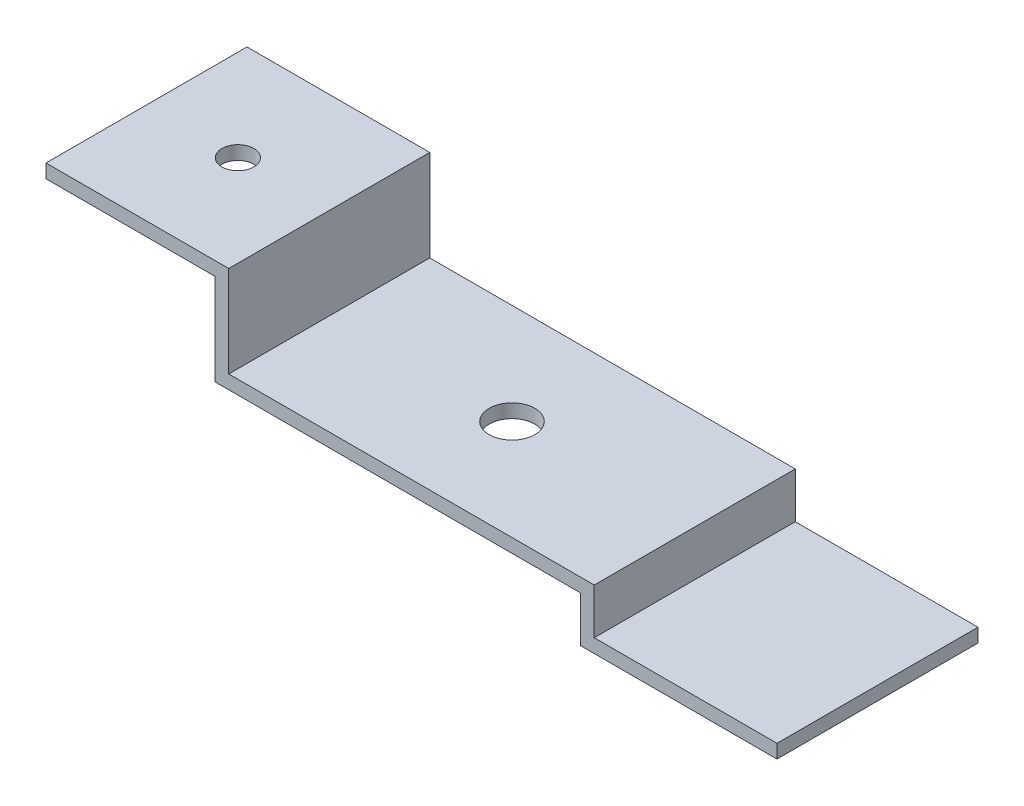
ISO-10303-21;
HEADER;
FILE_DESCRIPTION(('STEP AP214'),'2;1');
FILE_NAME('part.step','',(''),(''),'','','');
FILE_SCHEMA(('AUTOMOTIVE_DESIGN { 1 0 10303 214 1 1 1 1 }'));
ENDSEC;
DATA;
#1=APPLICATION_CONTEXT('core data for automotive mechanical design processes');
#2=APPLICATION_PROTOCOL_DEFINITION('international standard','automotive_design',2000,#1);
#3=PRODUCT_CONTEXT('',#1,'mechanical');
#4=PRODUCT('Part','Part','',(#3));
#5=PRODUCT_RELATED_PRODUCT_CATEGORY('part','',(#4));
#6=PRODUCT_DEFINITION_FORMATION('','',#4);
#7=PRODUCT_DEFINITION_CONTEXT('part definition',#1,'design');
#8=PRODUCT_DEFINITION('design','',#6,#7);
#9=PRODUCT_DEFINITION_SHAPE('','',#8);
#10=(LENGTH_UNIT() NAMED_UNIT(*) SI_UNIT(.MILLI.,.METRE.));
#11=(NAMED_UNIT(*) PLANE_ANGLE_UNIT() SI_UNIT($,.RADIAN.));
#12=(NAMED_UNIT(*) SI_UNIT($,.STERADIAN.) SOLID_ANGLE_UNIT());
#13=UNCERTAINTY_MEASURE_WITH_UNIT(LENGTH_MEASURE(1.E-05),#10,'distance_accuracy_value','');
#14=(GEOMETRIC_REPRESENTATION_CONTEXT(3) GLOBAL_UNCERTAINTY_ASSIGNED_CONTEXT((#13)) GLOBAL_UNIT_ASSIGNED_CONTEXT((#10,
#11,#12)) REPRESENTATION_CONTEXT('',''));
#15=CARTESIAN_POINT('',(0.,0.,0.));
#16=DIRECTION('',(0.,0.,1.));
#17=DIRECTION('',(1.,0.,0.));
#18=AXIS2_PLACEMENT_3D('',#15,#16,#17);
#19=CARTESIAN_POINT('',(0.,1.5,22.));
#20=DIRECTION('',(-1.,0.,0.));
#21=DIRECTION('',(0.,0.,1.));
#22=AXIS2_PLACEMENT_3D('',#19,#20,#21);
#23=PLANE('',#22);
#24=DIRECTION('',(0.,1.,0.));
#25=VECTOR('',#24,1.);
#26=CARTESIAN_POINT('',(0.,1.5,0.));
#27=LINE('',#26,#25);
#28=CARTESIAN_POINT('',(0.,0.,0.));
#29=VERTEX_POINT('',#28);
#30=CARTESIAN_POINT('',(0.,1.5,0.));
#31=VERTEX_POINT('',#30);
#32=EDGE_CURVE('E124',#29,#31,#27,.T.);
#33=ORIENTED_EDGE('',*,*,#32,.T.);
#34=DIRECTION('',(0.,0.,-1.));
#35=VECTOR('',#34,1.);
#36=CARTESIAN_POINT('',(0.,1.5,22.));
#37=LINE('',#36,#35);
#38=CARTESIAN_POINT('',(0.,1.5,22.));
#39=VERTEX_POINT('',#38);
#40=EDGE_CURVE('E11',#39,#31,#37,.T.);
#41=ORIENTED_EDGE('',*,*,#40,.F.);
#42=DIRECTION('',(0.,1.,0.));
#43=VECTOR('',#42,1.);
#44=CARTESIAN_POINT('',(0.,1.5,22.));
#45=LINE('',#44,#43);
#46=CARTESIAN_POINT('',(0.,0.,22.));
#47=VERTEX_POINT('',#46);
#48=EDGE_CURVE('E164',#47,#39,#45,.T.);
#49=ORIENTED_EDGE('',*,*,#48,.F.);
#50=DIRECTION('',(0.,0.,-1.));
#51=VECTOR('',#50,1.);
#52=CARTESIAN_POINT('',(0.,0.,22.));
#53=LINE('',#52,#51);
#54=EDGE_CURVE('E137',#47,#29,#53,.T.);
#55=ORIENTED_EDGE('',*,*,#54,.T.);
#56=EDGE_LOOP('',(#33,#41,#49,#55));
#57=FACE_BOUND('',#56,.T.);
#58=ADVANCED_FACE('F30',(#57),#23,.F.);
#59=CARTESIAN_POINT('',(-20.,1.5,22.));
#60=DIRECTION('',(0.,-1.,0.));
#61=DIRECTION('',(0.,0.,-1.));
#62=AXIS2_PLACEMENT_3D('',#59,#60,#61);
#63=PLANE('',#62);
#64=DIRECTION('',(-1.,0.,0.));
#65=VECTOR('',#64,1.);
#66=CARTESIAN_POINT('',(-20.,1.5,0.));
#67=LINE('',#66,#65);
#68=CARTESIAN_POINT('',(-20.,1.5,0.));
#69=VERTEX_POINT('',#68);
#70=EDGE_CURVE('E120',#31,#69,#67,.T.);
#71=ORIENTED_EDGE('',*,*,#70,.T.);
#72=DIRECTION('',(0.,0.,-1.));
#73=VECTOR('',#72,1.);
#74=CARTESIAN_POINT('',(-20.,1.5,22.));
#75=LINE('',#74,#73);
#76=CARTESIAN_POINT('',(-20.,1.5,22.));
#77=VERTEX_POINT('',#76);
#78=EDGE_CURVE('E38',#77,#69,#75,.T.);
#79=ORIENTED_EDGE('',*,*,#78,.F.);
#80=DIRECTION('',(-1.,0.,0.));
#81=VECTOR('',#80,1.);
#82=CARTESIAN_POINT('',(-20.,1.5,22.));
#83=LINE('',#82,#81);
#84=EDGE_CURVE('E133',#39,#77,#83,.T.);
#85=ORIENTED_EDGE('',*,*,#84,.F.);
#86=ORIENTED_EDGE('',*,*,#40,.T.);
#87=EDGE_LOOP('',(#71,#79,#85,#86));
#88=FACE_BOUND('',#87,.T.);
#89=ADVANCED_FACE('F132',(#88),#63,.F.);
#90=CARTESIAN_POINT('',(-20.,6.5,22.));
#91=DIRECTION('',(-1.,0.,0.));
#92=DIRECTION('',(0.,0.,1.));
#93=AXIS2_PLACEMENT_3D('',#90,#91,#92);
#94=PLANE('',#93);
#95=DIRECTION('',(0.,1.,0.));
#96=VECTOR('',#95,1.);
#97=CARTESIAN_POINT('',(-20.,6.5,0.));
#98=LINE('',#97,#96);
#99=CARTESIAN_POINT('',(-20.,6.5,0.));
#100=VERTEX_POINT('',#99);
#101=EDGE_CURVE('E126',#69,#100,#98,.T.);
#102=ORIENTED_EDGE('',*,*,#101,.T.);
#103=DIRECTION('',(0.,0.,-1.));
#104=VECTOR('',#103,1.);
#105=CARTESIAN_POINT('',(-20.,6.5,22.));
#106=LINE('',#105,#104);
#107=CARTESIAN_POINT('',(-20.,6.5,22.));
#108=VERTEX_POINT('',#107);
#109=EDGE_CURVE('E210',#108,#100,#106,.T.);
#110=ORIENTED_EDGE('',*,*,#109,.F.);
#111=DIRECTION('',(0.,1.,0.));
#112=VECTOR('',#111,1.);
#113=CARTESIAN_POINT('',(-20.,6.5,22.));
#114=LINE('',#113,#112);
#115=EDGE_CURVE('E167',#77,#108,#114,.T.);
#116=ORIENTED_EDGE('',*,*,#115,.F.);
#117=ORIENTED_EDGE('',*,*,#78,.T.);
#118=EDGE_LOOP('',(#102,#110,#116,#117));
#119=FACE_BOUND('',#118,.T.);
#120=ADVANCED_FACE('F215',(#119),#94,.F.);
#121=CARTESIAN_POINT('',(-60.,6.5,22.));
#122=DIRECTION('',(0.,-1.,0.));
#123=DIRECTION('',(0.,0.,-1.));
#124=AXIS2_PLACEMENT_3D('',#121,#122,#123);
#125=PLANE('',#124);
#126=CARTESIAN_POINT('',(-40.,6.5,11.));
#127=DIRECTION('',(0.,1.,0.));
#128=DIRECTION('',(0.,0.,1.));
#129=AXIS2_PLACEMENT_3D('',#126,#127,#128);
#130=CIRCLE('',#129,2.5);
#131=CARTESIAN_POINT('',(-40.,6.5,13.5));
#132=VERTEX_POINT('',#131);
#133=EDGE_CURVE('E296',#132,#132,#130,.T.);
#134=ORIENTED_EDGE('',*,*,#133,.F.);
#135=EDGE_LOOP('',(#134));
#136=FACE_BOUND('',#135,.T.);
#137=DIRECTION('',(-1.,0.,0.));
#138=VECTOR('',#137,1.);
#139=CARTESIAN_POINT('',(-60.,6.5,0.));
#140=LINE('',#139,#138);
#141=CARTESIAN_POINT('',(-60.,6.5,0.));
#142=VERTEX_POINT('',#141);
#143=EDGE_CURVE('E146',#100,#142,#140,.T.);
#144=ORIENTED_EDGE('',*,*,#143,.T.);
#145=DIRECTION('',(0.,0.,-1.));
#146=VECTOR('',#145,1.);
#147=CARTESIAN_POINT('',(-60.,6.5,22.));
#148=LINE('',#147,#146);
#149=CARTESIAN_POINT('',(-60.,6.5,22.));
#150=VERTEX_POINT('',#149);
#151=EDGE_CURVE('E207',#150,#142,#148,.T.);
#152=ORIENTED_EDGE('',*,*,#151,.F.);
#153=DIRECTION('',(-1.,0.,0.));
#154=VECTOR('',#153,1.);
#155=CARTESIAN_POINT('',(-60.,6.5,22.));
#156=LINE('',#155,#154);
#157=EDGE_CURVE('E169',#108,#150,#156,.T.);
#158=ORIENTED_EDGE('',*,*,#157,.F.);
#159=ORIENTED_EDGE('',*,*,#109,.T.);
#160=EDGE_LOOP('',(#144,#152,#158,#159));
#161=FACE_BOUND('',#160,.T.);
#162=ADVANCED_FACE('F223',(#136,#161),#125,.F.);
#163=CARTESIAN_POINT('',(-60.,16.5,22.));
#164=DIRECTION('',(-1.,0.,0.));
#165=DIRECTION('',(0.,0.,1.));
#166=AXIS2_PLACEMENT_3D('',#163,#164,#165);
#167=PLANE('',#166);
#168=DIRECTION('',(0.,1.,0.));
#169=VECTOR('',#168,1.);
#170=CARTESIAN_POINT('',(-60.,16.5,0.));
#171=LINE('',#170,#169);
#172=CARTESIAN_POINT('',(-60.,16.5,0.));
#173=VERTEX_POINT('',#172);
#174=EDGE_CURVE('E148',#142,#173,#171,.T.);
#175=ORIENTED_EDGE('',*,*,#174,.T.);
#176=DIRECTION('',(0.,0.,-1.));
#177=VECTOR('',#176,1.);
#178=CARTESIAN_POINT('',(-60.,16.5,22.));
#179=LINE('',#178,#177);
#180=CARTESIAN_POINT('',(-60.,16.5,22.));
#181=VERTEX_POINT('',#180);
#182=EDGE_CURVE('E204',#181,#173,#179,.T.);
#183=ORIENTED_EDGE('',*,*,#182,.F.);
#184=DIRECTION('',(0.,1.,0.));
#185=VECTOR('',#184,1.);
#186=CARTESIAN_POINT('',(-60.,16.5,22.));
#187=LINE('',#186,#185);
#188=EDGE_CURVE('E171',#150,#181,#187,.T.);
#189=ORIENTED_EDGE('',*,*,#188,.F.);
#190=ORIENTED_EDGE('',*,*,#151,.T.);
#191=EDGE_LOOP('',(#175,#183,#189,#190));
#192=FACE_BOUND('',#191,.T.);
#193=ADVANCED_FACE('F226',(#192),#167,.F.);
#194=CARTESIAN_POINT('',(-80.,16.5,22.));
#195=DIRECTION('',(0.,-1.,0.));
#196=DIRECTION('',(0.,0.,-1.));
#197=AXIS2_PLACEMENT_3D('',#194,#195,#196);
#198=PLANE('',#197);
#199=CARTESIAN_POINT('',(-70.,16.5,11.));
#200=DIRECTION('',(0.,1.,0.));
#201=DIRECTION('',(0.,0.,1.));
#202=AXIS2_PLACEMENT_3D('',#199,#200,#201);
#203=CIRCLE('',#202,1.75);
#204=CARTESIAN_POINT('',(-70.,16.5,12.75));
#205=VERTEX_POINT('',#204);
#206=EDGE_CURVE('E141',#205,#205,#203,.T.);
#207=ORIENTED_EDGE('',*,*,#206,.F.);
#208=EDGE_LOOP('',(#207));
#209=FACE_BOUND('',#208,.T.);
#210=DIRECTION('',(-1.,0.,0.));
#211=VECTOR('',#210,1.);
#212=CARTESIAN_POINT('',(-80.,16.5,0.));
#213=LINE('',#212,#211);
#214=CARTESIAN_POINT('',(-80.,16.5,0.));
#215=VERTEX_POINT('',#214);
#216=EDGE_CURVE('E150',#173,#215,#213,.T.);
#217=ORIENTED_EDGE('',*,*,#216,.T.);
#218=DIRECTION('',(0.,0.,-1.));
#219=VECTOR('',#218,1.);
#220=CARTESIAN_POINT('',(-80.,16.5,22.));
#221=LINE('',#220,#219);
#222=CARTESIAN_POINT('',(-80.,16.5,22.));
#223=VERTEX_POINT('',#222);
#224=EDGE_CURVE('E201',#223,#215,#221,.T.);
#225=ORIENTED_EDGE('',*,*,#224,.F.);
#226=DIRECTION('',(-1.,0.,0.));
#227=VECTOR('',#226,1.);
#228=CARTESIAN_POINT('',(-80.,16.5,22.));
#229=LINE('',#228,#227);
#230=EDGE_CURVE('E173',#181,#223,#229,.T.);
#231=ORIENTED_EDGE('',*,*,#230,.F.);
#232=ORIENTED_EDGE('',*,*,#182,.T.);
#233=EDGE_LOOP('',(#217,#225,#231,#232));
#234=FACE_BOUND('',#233,.T.);
#235=ADVANCED_FACE('F231',(#209,#234),#198,.F.);
#236=CARTESIAN_POINT('',(-80.,15.,22.));
#237=DIRECTION('',(1.,0.,0.));
#238=DIRECTION('',(0.,0.,-1.));
#239=AXIS2_PLACEMENT_3D('',#236,#237,#238);
#240=PLANE('',#239);
#241=DIRECTION('',(0.,-1.,0.));
#242=VECTOR('',#241,1.);
#243=CARTESIAN_POINT('',(-80.,15.,0.));
#244=LINE('',#243,#242);
#245=CARTESIAN_POINT('',(-80.,15.,0.));
#246=VERTEX_POINT('',#245);
#247=EDGE_CURVE('E152',#215,#246,#244,.T.);
#248=ORIENTED_EDGE('',*,*,#247,.T.);
#249=DIRECTION('',(0.,0.,-1.));
#250=VECTOR('',#249,1.);
#251=CARTESIAN_POINT('',(-80.,15.,22.));
#252=LINE('',#251,#250);
#253=CARTESIAN_POINT('',(-80.,15.,22.));
#254=VERTEX_POINT('',#253);
#255=EDGE_CURVE('E198',#254,#246,#252,.T.);
#256=ORIENTED_EDGE('',*,*,#255,.F.);
#257=DIRECTION('',(0.,-1.,0.));
#258=VECTOR('',#257,1.);
#259=CARTESIAN_POINT('',(-80.,15.,22.));
#260=LINE('',#259,#258);
#261=EDGE_CURVE('E175',#223,#254,#260,.T.);
#262=ORIENTED_EDGE('',*,*,#261,.F.);
#263=ORIENTED_EDGE('',*,*,#224,.T.);
#264=EDGE_LOOP('',(#248,#256,#262,#263));
#265=FACE_BOUND('',#264,.T.);
#266=ADVANCED_FACE('F237',(#265),#240,.F.);
#267=CARTESIAN_POINT('',(-61.5,15.,22.));
#268=DIRECTION('',(0.,1.,0.));
#269=DIRECTION('',(-1.,0.,0.));
#270=AXIS2_PLACEMENT_3D('',#267,#268,#269);
#271=PLANE('',#270);
#272=CARTESIAN_POINT('',(-70.,15.,11.));
#273=DIRECTION('',(0.,1.,0.));
#274=DIRECTION('',(-1.,0.,0.));
#275=AXIS2_PLACEMENT_3D('',#272,#273,#274);
#276=CIRCLE('',#275,1.75);
#277=CARTESIAN_POINT('',(-71.75,15.,11.));
#278=VERTEX_POINT('',#277);
#279=EDGE_CURVE('E138',#278,#278,#276,.T.);
#280=ORIENTED_EDGE('',*,*,#279,.T.);
#281=EDGE_LOOP('',(#280));
#282=FACE_BOUND('',#281,.T.);
#283=DIRECTION('',(1.,0.,0.));
#284=VECTOR('',#283,1.);
#285=CARTESIAN_POINT('',(-61.5,15.,0.));
#286=LINE('',#285,#284);
#287=CARTESIAN_POINT('',(-61.5,15.,0.));
#288=VERTEX_POINT('',#287);
#289=EDGE_CURVE('E154',#246,#288,#286,.T.);
#290=ORIENTED_EDGE('',*,*,#289,.T.);
#291=DIRECTION('',(0.,0.,-1.));
#292=VECTOR('',#291,1.);
#293=CARTESIAN_POINT('',(-61.5,15.,22.));
#294=LINE('',#293,#292);
#295=CARTESIAN_POINT('',(-61.5,15.,22.));
#296=VERTEX_POINT('',#295);
#297=EDGE_CURVE('E195',#296,#288,#294,.T.);
#298=ORIENTED_EDGE('',*,*,#297,.F.);
#299=DIRECTION('',(1.,0.,0.));
#300=VECTOR('',#299,1.);
#301=CARTESIAN_POINT('',(-61.5,15.,22.));
#302=LINE('',#301,#300);
#303=EDGE_CURVE('E177',#254,#296,#302,.T.);
#304=ORIENTED_EDGE('',*,*,#303,.F.);
#305=ORIENTED_EDGE('',*,*,#255,.T.);
#306=EDGE_LOOP('',(#290,#298,#304,#305));
#307=FACE_BOUND('',#306,.T.);
#308=ADVANCED_FACE('F241',(#282,#307),#271,.F.);
#309=CARTESIAN_POINT('',(-61.5,4.99999999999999,22.));
#310=DIRECTION('',(1.,0.,0.));
#311=DIRECTION('',(0.,0.,-1.));
#312=AXIS2_PLACEMENT_3D('',#309,#310,#311);
#313=PLANE('',#312);
#314=DIRECTION('',(0.,-1.,0.));
#315=VECTOR('',#314,1.);
#316=CARTESIAN_POINT('',(-61.5,4.99999999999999,0.));
#317=LINE('',#316,#315);
#318=CARTESIAN_POINT('',(-61.5,4.99999999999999,0.));
#319=VERTEX_POINT('',#318);
#320=EDGE_CURVE('E156',#288,#319,#317,.T.);
#321=ORIENTED_EDGE('',*,*,#320,.T.);
#322=DIRECTION('',(0.,0.,-1.));
#323=VECTOR('',#322,1.);
#324=CARTESIAN_POINT('',(-61.5,4.99999999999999,22.));
#325=LINE('',#324,#323);
#326=CARTESIAN_POINT('',(-61.5,4.99999999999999,22.));
#327=VERTEX_POINT('',#326);
#328=EDGE_CURVE('E192',#327,#319,#325,.T.);
#329=ORIENTED_EDGE('',*,*,#328,.F.);
#330=DIRECTION('',(0.,-1.,0.));
#331=VECTOR('',#330,1.);
#332=CARTESIAN_POINT('',(-61.5,4.99999999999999,22.));
#333=LINE('',#332,#331);
#334=EDGE_CURVE('E179',#296,#327,#333,.T.);
#335=ORIENTED_EDGE('',*,*,#334,.F.);
#336=ORIENTED_EDGE('',*,*,#297,.T.);
#337=EDGE_LOOP('',(#321,#329,#335,#336));
#338=FACE_BOUND('',#337,.T.);
#339=ADVANCED_FACE('F246',(#338),#313,.F.);
#340=CARTESIAN_POINT('',(-21.5,5.,22.));
#341=DIRECTION('',(0.,1.,0.));
#342=DIRECTION('',(-1.,0.,0.));
#343=AXIS2_PLACEMENT_3D('',#340,#341,#342);
#344=PLANE('',#343);
#345=CARTESIAN_POINT('',(-40.,5.,11.));
#346=DIRECTION('',(0.,1.,0.));
#347=DIRECTION('',(-1.,0.,0.));
#348=AXIS2_PLACEMENT_3D('',#345,#346,#347);
#349=CIRCLE('',#348,2.5);
#350=CARTESIAN_POINT('',(-42.5,5.,11.));
#351=VERTEX_POINT('',#350);
#352=EDGE_CURVE('E33',#351,#351,#349,.T.);
#353=ORIENTED_EDGE('',*,*,#352,.T.);
#354=EDGE_LOOP('',(#353));
#355=FACE_BOUND('',#354,.T.);
#356=DIRECTION('',(1.,0.,0.));
#357=VECTOR('',#356,1.);
#358=CARTESIAN_POINT('',(-21.5,5.,0.));
#359=LINE('',#358,#357);
#360=CARTESIAN_POINT('',(-21.5,5.,0.));
#361=VERTEX_POINT('',#360);
#362=EDGE_CURVE('E158',#319,#361,#359,.T.);
#363=ORIENTED_EDGE('',*,*,#362,.T.);
#364=DIRECTION('',(0.,0.,-1.));
#365=VECTOR('',#364,1.);
#366=CARTESIAN_POINT('',(-21.5,5.,22.));
#367=LINE('',#366,#365);
#368=CARTESIAN_POINT('',(-21.5,5.,22.));
#369=VERTEX_POINT('',#368);
#370=EDGE_CURVE('E189',#369,#361,#367,.T.);
#371=ORIENTED_EDGE('',*,*,#370,.F.);
#372=DIRECTION('',(1.,0.,0.));
#373=VECTOR('',#372,1.);
#374=CARTESIAN_POINT('',(-21.5,5.,22.));
#375=LINE('',#374,#373);
#376=EDGE_CURVE('E181',#327,#369,#375,.T.);
#377=ORIENTED_EDGE('',*,*,#376,.F.);
#378=ORIENTED_EDGE('',*,*,#328,.T.);
#379=EDGE_LOOP('',(#363,#371,#377,#378));
#380=FACE_BOUND('',#379,.T.);
#381=ADVANCED_FACE('F250',(#355,#380),#344,.F.);
#382=CARTESIAN_POINT('',(-21.5,0.,22.));
#383=DIRECTION('',(1.,0.,0.));
#384=DIRECTION('',(0.,0.,-1.));
#385=AXIS2_PLACEMENT_3D('',#382,#383,#384);
#386=PLANE('',#385);
#387=DIRECTION('',(0.,-1.,0.));
#388=VECTOR('',#387,1.);
#389=CARTESIAN_POINT('',(-21.5,0.,0.));
#390=LINE('',#389,#388);
#391=CARTESIAN_POINT('',(-21.5,0.,0.));
#392=VERTEX_POINT('',#391);
#393=EDGE_CURVE('E160',#361,#392,#390,.T.);
#394=ORIENTED_EDGE('',*,*,#393,.T.);
#395=DIRECTION('',(0.,0.,-1.));
#396=VECTOR('',#395,1.);
#397=CARTESIAN_POINT('',(-21.5,0.,22.));
#398=LINE('',#397,#396);
#399=CARTESIAN_POINT('',(-21.5,0.,22.));
#400=VERTEX_POINT('',#399);
#401=EDGE_CURVE('E186',#400,#392,#398,.T.);
#402=ORIENTED_EDGE('',*,*,#401,.F.);
#403=DIRECTION('',(0.,-1.,0.));
#404=VECTOR('',#403,1.);
#405=CARTESIAN_POINT('',(-21.5,0.,22.));
#406=LINE('',#405,#404);
#407=EDGE_CURVE('E51',#369,#400,#406,.T.);
#408=ORIENTED_EDGE('',*,*,#407,.F.);
#409=ORIENTED_EDGE('',*,*,#370,.T.);
#410=EDGE_LOOP('',(#394,#402,#408,#409));
#411=FACE_BOUND('',#410,.T.);
#412=ADVANCED_FACE('F254',(#411),#386,.F.);
#413=CARTESIAN_POINT('',(0.,0.,22.));
#414=DIRECTION('',(0.,1.,0.));
#415=DIRECTION('',(-1.,0.,0.));
#416=AXIS2_PLACEMENT_3D('',#413,#414,#415);
#417=PLANE('',#416);
#418=DIRECTION('',(1.,0.,0.));
#419=VECTOR('',#418,1.);
#420=CARTESIAN_POINT('',(0.,0.,0.));
#421=LINE('',#420,#419);
#422=EDGE_CURVE('E162',#392,#29,#421,.T.);
#423=ORIENTED_EDGE('',*,*,#422,.T.);
#424=ORIENTED_EDGE('',*,*,#54,.F.);
#425=DIRECTION('',(1.,0.,0.));
#426=VECTOR('',#425,1.);
#427=CARTESIAN_POINT('',(0.,0.,22.));
#428=LINE('',#427,#426);
#429=EDGE_CURVE('E46',#400,#47,#428,.T.);
#430=ORIENTED_EDGE('',*,*,#429,.F.);
#431=ORIENTED_EDGE('',*,*,#401,.T.);
#432=EDGE_LOOP('',(#423,#424,#430,#431));
#433=FACE_BOUND('',#432,.T.);
#434=ADVANCED_FACE('F256',(#433),#417,.F.);
#435=CARTESIAN_POINT('',(0.,16.5,22.));
#436=DIRECTION('',(0.,0.,1.));
#437=DIRECTION('',(1.,0.,0.));
#438=AXIS2_PLACEMENT_3D('',#435,#436,#437);
#439=PLANE('',#438);
#440=ORIENTED_EDGE('',*,*,#48,.T.);
#441=ORIENTED_EDGE('',*,*,#84,.T.);
#442=ORIENTED_EDGE('',*,*,#115,.T.);
#443=ORIENTED_EDGE('',*,*,#157,.T.);
#444=ORIENTED_EDGE('',*,*,#188,.T.);
#445=ORIENTED_EDGE('',*,*,#230,.T.);
#446=ORIENTED_EDGE('',*,*,#261,.T.);
#447=ORIENTED_EDGE('',*,*,#303,.T.);
#448=ORIENTED_EDGE('',*,*,#334,.T.);
#449=ORIENTED_EDGE('',*,*,#376,.T.);
#450=ORIENTED_EDGE('',*,*,#407,.T.);
#451=ORIENTED_EDGE('',*,*,#429,.T.);
#452=EDGE_LOOP('',(#440,#441,#442,#443,#444,#445,#446,#447,#448,#449,#450,#451));
#453=FACE_BOUND('',#452,.T.);
#454=ADVANCED_FACE('F218',(#453),#439,.T.);
#455=CARTESIAN_POINT('',(0.,16.5,0.));
#456=DIRECTION('',(0.,0.,1.));
#457=DIRECTION('',(1.,0.,0.));
#458=AXIS2_PLACEMENT_3D('',#455,#456,#457);
#459=PLANE('',#458);
#460=ORIENTED_EDGE('',*,*,#32,.F.);
#461=ORIENTED_EDGE('',*,*,#422,.F.);
#462=ORIENTED_EDGE('',*,*,#393,.F.);
#463=ORIENTED_EDGE('',*,*,#362,.F.);
#464=ORIENTED_EDGE('',*,*,#320,.F.);
#465=ORIENTED_EDGE('',*,*,#289,.F.);
#466=ORIENTED_EDGE('',*,*,#247,.F.);
#467=ORIENTED_EDGE('',*,*,#216,.F.);
#468=ORIENTED_EDGE('',*,*,#174,.F.);
#469=ORIENTED_EDGE('',*,*,#143,.F.);
#470=ORIENTED_EDGE('',*,*,#101,.F.);
#471=ORIENTED_EDGE('',*,*,#70,.F.);
#472=EDGE_LOOP('',(#460,#461,#462,#463,#464,#465,#466,#467,#468,#469,#470,#471));
#473=FACE_BOUND('',#472,.T.);
#474=ADVANCED_FACE('F121',(#473),#459,.F.);
#475=CARTESIAN_POINT('',(-70.,-5.5,11.));
#476=DIRECTION('',(0.,1.,0.));
#477=DIRECTION('',(0.,0.,1.));
#478=AXIS2_PLACEMENT_3D('',#475,#476,#477);
#479=CYLINDRICAL_SURFACE('',#478,1.75);
#480=ORIENTED_EDGE('',*,*,#206,.T.);
#481=EDGE_LOOP('',(#480));
#482=FACE_BOUND('',#481,.T.);
#483=ORIENTED_EDGE('',*,*,#279,.F.);
#484=EDGE_LOOP('',(#483));
#485=FACE_BOUND('',#484,.T.);
#486=ADVANCED_FACE('F303',(#482,#485),#479,.F.);
#487=CARTESIAN_POINT('',(-40.,-15.5,11.));
#488=DIRECTION('',(0.,1.,0.));
#489=DIRECTION('',(0.,0.,1.));
#490=AXIS2_PLACEMENT_3D('',#487,#488,#489);
#491=CYLINDRICAL_SURFACE('',#490,2.5);
#492=ORIENTED_EDGE('',*,*,#133,.T.);
#493=EDGE_LOOP('',(#492));
#494=FACE_BOUND('',#493,.T.);
#495=ORIENTED_EDGE('',*,*,#352,.F.);
#496=EDGE_LOOP('',(#495));
#497=FACE_BOUND('',#496,.T.);
#498=ADVANCED_FACE('F301',(#494,#497),#491,.F.);
#499=CLOSED_SHELL('',(#58,#89,#120,#162,#193,#235,#266,#308,#339,#381,#412,#434,#454,#474,#486,#498));
#500=MANIFOLD_SOLID_BREP('B2',#499);
#501=ADVANCED_BREP_SHAPE_REPRESENTATION('',(#18,#500),#14);
#502=SHAPE_DEFINITION_REPRESENTATION(#9,#501);
ENDSEC;
END-ISO-10303-21;
